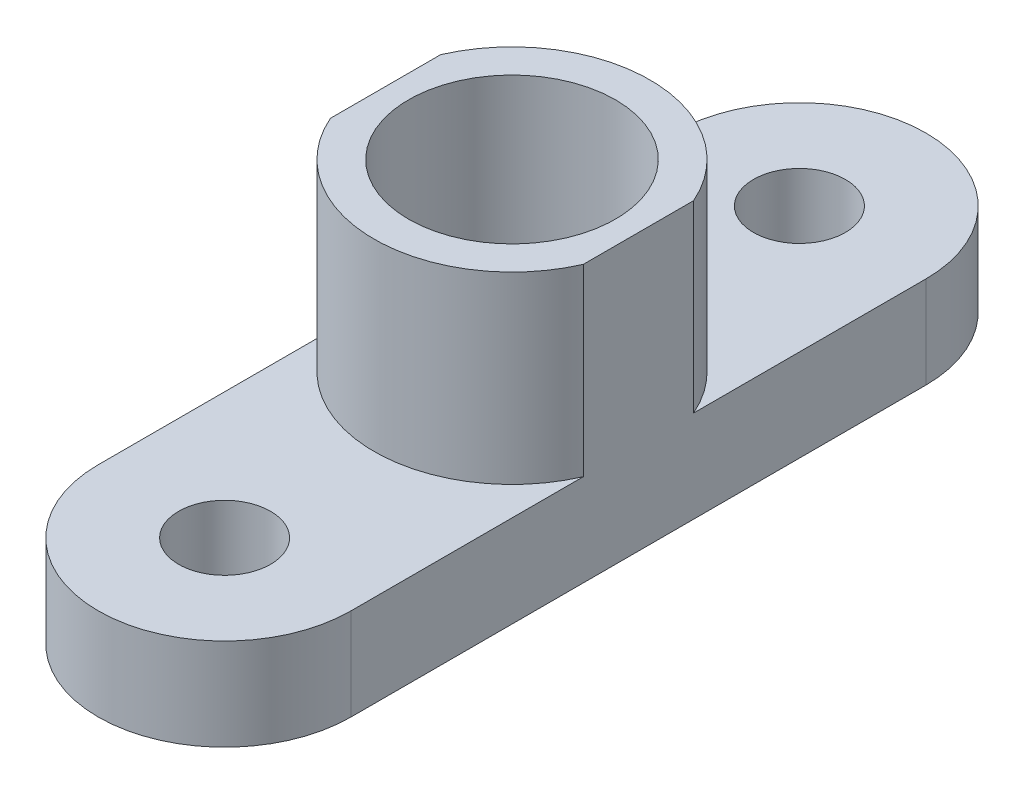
from build123d import *

# Parameters (mm, degrees)
EXTRUDE_1_DEPTH     = 16
SKETCH_2_R          = 4
EXTRUDE_2_DEPTH     = 8
CUT_EXTRUDE_START   = -24
SKETCH_3_R          = 9
CUT_EXTRUDE_1_DEPTH = 24


with BuildPart() as part:
    # Sketch 1 → Extrude 1 (new body)
    with BuildSketch(Plane(origin=(0, 0, 0), x_dir=(1, 0, 0), z_dir=(0, 1, 0))):
        with BuildLine():
            Line((11, 4.795831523), (11, -4.795831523))
            ThreePointArc((11, -4.795831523), (0, -12), (-11, -4.795831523))
            Line((-11, -4.795831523), (-11, 4.795831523))
            ThreePointArc((-11, 4.795831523), (0, 12), (11, 4.795831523))
        make_face()
    extrude(amount=EXTRUDE_1_DEPTH)

    # Sketch 2 → Extrude 2 (add)
    with BuildSketch(Plane.XZ):
        with BuildLine():
            Line((11, 25), (11, -25))
            ThreePointArc((11, -25), (0, -36), (-11, -25))
            Line((-11, -25), (-11, 25))
            ThreePointArc((-11, 25), (0, 36), (11, 25))
        make_face()
        with Locations(Location((0, -25, 0), (0, 0, 270))):
            Circle(SKETCH_2_R, mode=Mode.SUBTRACT)
        with Locations(Location((0, 25, 0), (0, 0, 270))):
            Circle(SKETCH_2_R, mode=Mode.SUBTRACT)
    extrude(amount=EXTRUDE_2_DEPTH)

    # Sketch 3 → Cut-Extrude 1 (cut)
    with BuildSketch(Plane(origin=(0, 16, 0), x_dir=(-1, 0, 0), z_dir=(0, 1, 0)).offset(CUT_EXTRUDE_START)):
        with Locations(Location((0, 0, 0), (0, 0, 90))):
            Circle(SKETCH_3_R)
    extrude(amount=CUT_EXTRUDE_1_DEPTH, mode=Mode.SUBTRACT)


solid = part.part
